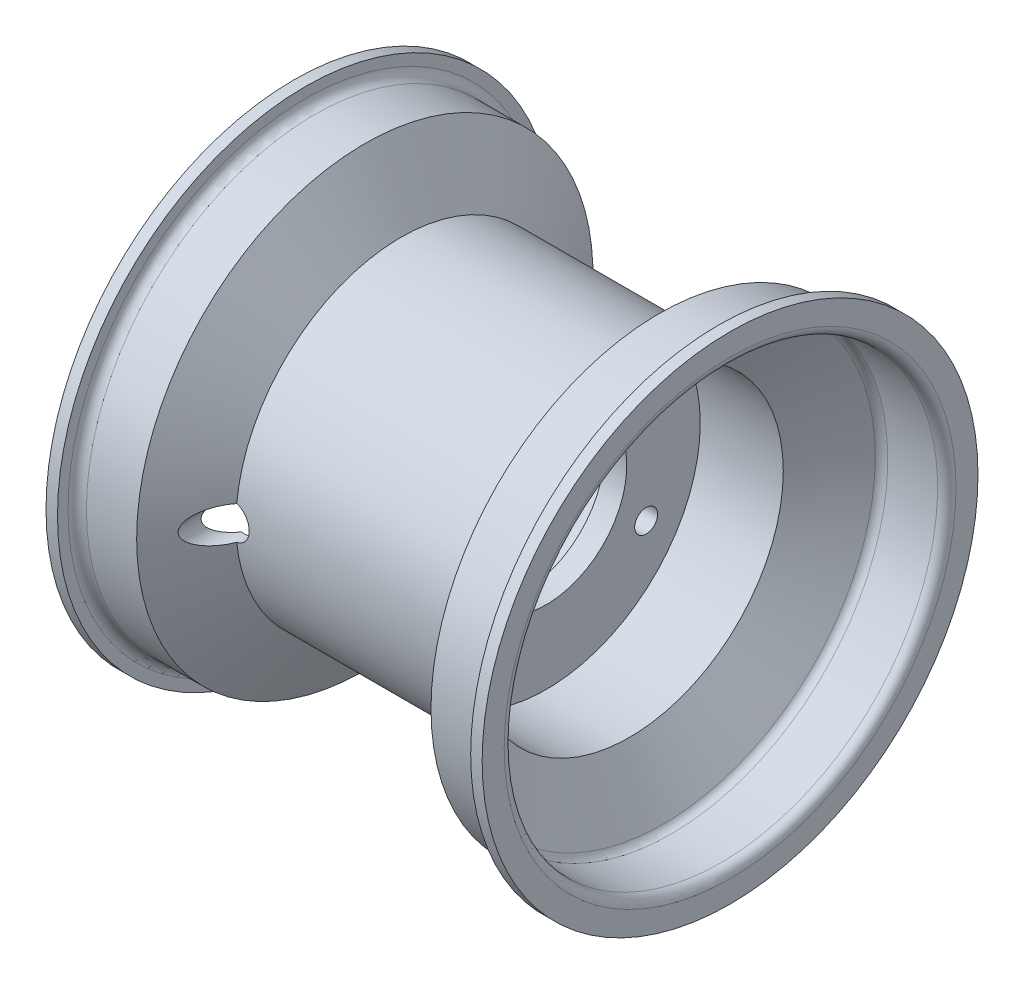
ISO-10303-21;
HEADER;
FILE_DESCRIPTION(('STEP AP214'),'2;1');
FILE_NAME('part.step','',(''),(''),'','','');
FILE_SCHEMA(('AUTOMOTIVE_DESIGN { 1 0 10303 214 1 1 1 1 }'));
ENDSEC;
DATA;
#1=APPLICATION_CONTEXT('core data for automotive mechanical design processes');
#2=APPLICATION_PROTOCOL_DEFINITION('international standard','automotive_design',2000,#1);
#3=PRODUCT_CONTEXT('',#1,'mechanical');
#4=PRODUCT('Part','Part','',(#3));
#5=PRODUCT_RELATED_PRODUCT_CATEGORY('part','',(#4));
#6=PRODUCT_DEFINITION_FORMATION('','',#4);
#7=PRODUCT_DEFINITION_CONTEXT('part definition',#1,'design');
#8=PRODUCT_DEFINITION('design','',#6,#7);
#9=PRODUCT_DEFINITION_SHAPE('','',#8);
#10=(LENGTH_UNIT() NAMED_UNIT(*) SI_UNIT(.MILLI.,.METRE.));
#11=(NAMED_UNIT(*) PLANE_ANGLE_UNIT() SI_UNIT($,.RADIAN.));
#12=(NAMED_UNIT(*) SI_UNIT($,.STERADIAN.) SOLID_ANGLE_UNIT());
#13=UNCERTAINTY_MEASURE_WITH_UNIT(LENGTH_MEASURE(1.E-05),#10,'distance_accuracy_value','');
#14=(GEOMETRIC_REPRESENTATION_CONTEXT(3) GLOBAL_UNCERTAINTY_ASSIGNED_CONTEXT((#13)) GLOBAL_UNIT_ASSIGNED_CONTEXT((#10,
#11,#12)) REPRESENTATION_CONTEXT('',''));
#15=CARTESIAN_POINT('',(0.,0.,0.));
#16=DIRECTION('',(0.,0.,1.));
#17=DIRECTION('',(1.,0.,0.));
#18=AXIS2_PLACEMENT_3D('',#15,#16,#17);
#19=CARTESIAN_POINT('',(-41.8117651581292,0.,0.));
#20=DIRECTION('',(-1.,0.,0.));
#21=DIRECTION('',(0.,0.,1.));
#22=AXIS2_PLACEMENT_3D('',#19,#20,#21);
#23=CONICAL_SURFACE('',#22,58.674,1.0471975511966);
#24=CARTESIAN_POINT('',(-41.8117651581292,0.,0.));
#25=DIRECTION('',(-1.,0.,0.));
#26=DIRECTION('',(0.,0.,1.));
#27=AXIS2_PLACEMENT_3D('',#24,#25,#26);
#28=CIRCLE('',#27,58.674);
#29=CARTESIAN_POINT('',(-41.8117651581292,0.,58.674));
#30=VERTEX_POINT('',#29);
#31=EDGE_CURVE('E128',#30,#30,#28,.T.);
#32=ORIENTED_EDGE('',*,*,#31,.T.);
#33=EDGE_LOOP('',(#32));
#34=FACE_BOUND('',#33,.T.);
#35=CARTESIAN_POINT('',(-32.0982009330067,-4.74975392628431,41.5792011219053));
#36=CARTESIAN_POINT('',(-32.1962882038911,-4.74255393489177,41.7510195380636));
#37=CARTESIAN_POINT('',(-32.2941819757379,-4.73233163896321,41.9228224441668));
#38=CARTESIAN_POINT('',(-32.4895074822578,-4.70577020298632,42.2662336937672));
#39=CARTESIAN_POINT('',(-32.5869391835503,-4.68943062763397,42.4378420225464));
#40=CARTESIAN_POINT('',(-32.781455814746,-4.65052253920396,42.7810365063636));
#41=CARTESIAN_POINT('',(-32.8785395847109,-4.62794100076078,42.9526218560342));
#42=CARTESIAN_POINT('',(-33.0720473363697,-4.57641931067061,43.2951884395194));
#43=CARTESIAN_POINT('',(-33.1684713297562,-4.54747927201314,43.4661696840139));
#44=CARTESIAN_POINT('',(-33.461641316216,-4.44915731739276,43.9868418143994));
#45=CARTESIAN_POINT('',(-33.6572202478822,-4.36925720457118,44.3353219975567));
#46=CARTESIAN_POINT('',(-33.9471570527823,-4.226754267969,44.8534301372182));
#47=CARTESIAN_POINT('',(-34.0431982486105,-4.17549936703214,45.0253057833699));
#48=CARTESIAN_POINT('',(-34.2339633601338,-4.06491032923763,45.3671726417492));
#49=CARTESIAN_POINT('',(-34.3286874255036,-4.00557711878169,45.5371640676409));
#50=CARTESIAN_POINT('',(-34.5331902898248,-3.86692562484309,45.9046465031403));
#51=CARTESIAN_POINT('',(-34.6426657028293,-3.78592885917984,46.101678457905));
#52=CARTESIAN_POINT('',(-34.8588668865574,-3.61050484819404,46.4913561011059));
#53=CARTESIAN_POINT('',(-34.9655918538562,-3.51607372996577,46.6840005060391));
#54=CARTESIAN_POINT('',(-35.1746101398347,-3.31278733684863,47.0617965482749));
#55=CARTESIAN_POINT('',(-35.2769305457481,-3.20404473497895,47.2469933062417));
#56=CARTESIAN_POINT('',(-35.4766305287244,-2.96940460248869,47.6088868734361));
#57=CARTESIAN_POINT('',(-35.5740144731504,-2.84352261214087,47.7855911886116));
#58=CARTESIAN_POINT('',(-35.7507730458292,-2.58774866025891,48.106674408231));
#59=CARTESIAN_POINT('',(-35.8309145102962,-2.46009806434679,48.2524029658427));
#60=CARTESIAN_POINT('',(-35.9839043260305,-2.18634281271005,48.5308381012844));
#61=CARTESIAN_POINT('',(-36.0567381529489,-2.04020266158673,48.6635187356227));
#62=CARTESIAN_POINT('',(-36.1582257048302,-1.80454715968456,48.8485301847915));
#63=CARTESIAN_POINT('',(-36.1909766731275,-1.72257595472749,48.9082596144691));
#64=CARTESIAN_POINT('',(-36.2530376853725,-1.55312735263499,49.0214806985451));
#65=CARTESIAN_POINT('',(-36.2823471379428,-1.46564901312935,49.0749712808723));
#66=CARTESIAN_POINT('',(-36.3366847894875,-1.28551108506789,49.1741671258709));
#67=CARTESIAN_POINT('',(-36.3617279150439,-1.19287113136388,49.2198995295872));
#68=CARTESIAN_POINT('',(-36.4068137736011,-1.0025240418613,49.3022514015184));
#69=CARTESIAN_POINT('',(-36.4268605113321,-0.904821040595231,49.3388781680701));
#70=CARTESIAN_POINT('',(-36.4654907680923,-0.679480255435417,49.4094694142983));
#71=CARTESIAN_POINT('',(-36.4823995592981,-0.550558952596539,49.4403768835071));
#72=CARTESIAN_POINT('',(-36.505557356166,-0.288666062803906,49.4827098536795));
#73=CARTESIAN_POINT('',(-36.5118156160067,-0.155698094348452,49.4941522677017));
#74=CARTESIAN_POINT('',(-36.5130780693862,0.110694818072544,49.4964603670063));
#75=CARTESIAN_POINT('',(-36.5080644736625,0.24412015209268,49.4872935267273));
#76=CARTESIAN_POINT('',(-36.4872519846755,0.507272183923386,49.4492468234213));
#77=CARTESIAN_POINT('',(-36.4714442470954,0.636995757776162,49.4203507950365));
#78=CARTESIAN_POINT('',(-36.4253084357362,0.921103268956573,49.3360399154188));
#79=CARTESIAN_POINT('',(-36.3923502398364,1.07361662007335,49.2758232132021));
#80=CARTESIAN_POINT('',(-36.31503828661,1.36556807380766,49.1346406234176));
#81=CARTESIAN_POINT('',(-36.2706633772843,1.50498124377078,49.0536362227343));
#82=CARTESIAN_POINT('',(-36.1843750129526,1.74061764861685,48.8962158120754));
#83=CARTESIAN_POINT('',(-36.1441272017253,1.83953076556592,48.8228191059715));
#84=CARTESIAN_POINT('',(-36.0595864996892,2.0297059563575,48.6687275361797));
#85=CARTESIAN_POINT('',(-36.0152912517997,2.12096351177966,48.5880284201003));
#86=CARTESIAN_POINT('',(-35.9234402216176,2.2964380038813,48.4207828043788));
#87=CARTESIAN_POINT('',(-35.8758794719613,2.38064376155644,48.3342273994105));
#88=CARTESIAN_POINT('',(-35.7781724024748,2.54247141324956,48.1565167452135));
#89=CARTESIAN_POINT('',(-35.7280251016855,2.62009077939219,48.0653597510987));
#90=CARTESIAN_POINT('',(-35.581565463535,2.83353613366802,47.7992959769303));
#91=CARTESIAN_POINT('',(-35.4826736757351,2.96194955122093,47.6198451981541));
#92=CARTESIAN_POINT('',(-35.2797928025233,3.20102096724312,47.2521735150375));
#93=CARTESIAN_POINT('',(-35.1757993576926,3.3116634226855,47.0639451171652));
#94=CARTESIAN_POINT('',(-34.9635805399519,3.51799688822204,46.6803660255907));
#95=CARTESIAN_POINT('',(-34.8553370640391,3.61361266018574,46.4849851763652));
#96=CARTESIAN_POINT('',(-34.6360343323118,3.791054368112,46.0897354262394));
#97=CARTESIAN_POINT('',(-34.5249758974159,3.87288427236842,45.8898678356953));
#98=CARTESIAN_POINT('',(-34.3193665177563,4.01153986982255,45.5204311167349));
#99=CARTESIAN_POINT('',(-34.2251563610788,4.07025908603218,45.3513766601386));
#100=CARTESIAN_POINT('',(-34.0354415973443,4.1797307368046,45.0114195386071));
#101=CARTESIAN_POINT('',(-33.9399368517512,4.23048231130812,44.840516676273));
#102=CARTESIAN_POINT('',(-33.6516413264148,4.37161989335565,44.3253762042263));
#103=CARTESIAN_POINT('',(-33.4571936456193,4.45080667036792,43.9789302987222));
#104=CARTESIAN_POINT('',(-33.1654441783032,4.54841565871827,43.4607996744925));
#105=CARTESIAN_POINT('',(-33.0692919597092,4.57720790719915,43.2903058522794));
#106=CARTESIAN_POINT('',(-32.8763325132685,4.62847218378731,42.9487195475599));
#107=CARTESIAN_POINT('',(-32.7795252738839,4.65094410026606,42.7776270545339));
#108=CARTESIAN_POINT('',(-32.5855592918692,4.68967068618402,42.4354107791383));
#109=CARTESIAN_POINT('',(-32.4884016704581,4.70593795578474,42.2642877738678));
#110=CARTESIAN_POINT('',(-32.2936271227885,4.73238960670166,41.9218486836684));
#111=CARTESIAN_POINT('',(-32.1960102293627,4.74257441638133,41.7505326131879));
#112=CARTESIAN_POINT('',(-32.0982009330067,4.74975392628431,41.5792011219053));
#113=B_SPLINE_CURVE_WITH_KNOTS('',3,(#35,#36,#37,#38,#39,#40,#41,#42,#43,#44,#45,#46,#47,#48,
#49,#50,#51,#52,#53,#54,#55,#56,#57,#58,#59,#60,#61,#62,#63,#64,#65,#66,#67,#68,#69,#70,#71,#72,
#73,#74,#75,#76,#77,#78,#79,#80,#81,#82,#83,#84,#85,#86,#87,#88,#89,#90,#91,#92,#93,#94,#95,#96,
#97,#98,#99,#100,#101,#102,#103,#104,#105,#106,#107,#108,#109,#110,#111,#112),.UNSPECIFIED.,.F.,
.F.,(4,2,2,2,2,2,2,2,2,2,2,2,2,2,2,2,2,2,2,2,2,2,2,2,2,2,2,2,2,2,2,2,2,2,2,2,2,2,4),(0.,
0.593904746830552,1.18785176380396,1.78304767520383,2.37823301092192,3.5995126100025,
4.20973239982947,4.81988226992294,5.53804397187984,6.25641312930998,6.96943171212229,
7.68180805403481,8.30979900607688,8.93901437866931,9.25845179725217,9.57794402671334,
9.89629440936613,10.2143887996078,10.6135446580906,11.0123535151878,11.4117922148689,
11.8115585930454,12.3105459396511,12.810464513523,13.1986756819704,13.5871143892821,
13.9761576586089,14.365349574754,15.0895717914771,15.8144240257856,16.5427972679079,
17.2709604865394,17.8775123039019,18.4841295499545,19.6981680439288,20.2916327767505,
20.8851079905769,21.4773714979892,22.0695932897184),.UNSPECIFIED.);
#114=CARTESIAN_POINT('',(-32.4996826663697,-4.70312472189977,42.2842481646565));
#115=VERTEX_POINT('',#114);
#116=CARTESIAN_POINT('',(-32.4996826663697,4.70312472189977,42.2842481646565));
#117=VERTEX_POINT('',#116);
#118=EDGE_CURVE('E52',#115,#117,#113,.T.);
#119=ORIENTED_EDGE('',*,*,#118,.F.);
#120=CARTESIAN_POINT('',(-32.4996826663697,0.,0.));
#121=DIRECTION('',(-1.,0.,0.));
#122=DIRECTION('',(0.,0.,1.));
#123=AXIS2_PLACEMENT_3D('',#120,#121,#122);
#124=CIRCLE('',#123,42.545);
#125=EDGE_CURVE('E125',#117,#115,#124,.T.);
#126=ORIENTED_EDGE('',*,*,#125,.F.);
#127=EDGE_LOOP('',(#119,#126));
#128=FACE_BOUND('',#127,.T.);
#129=ADVANCED_FACE('F33',(#34,#128),#23,.F.);
#130=CARTESIAN_POINT('',(0.,0.,0.));
#131=DIRECTION('',(-1.,0.,0.));
#132=DIRECTION('',(0.,0.,1.));
#133=AXIS2_PLACEMENT_3D('',#130,#131,#132);
#134=CYLINDRICAL_SURFACE('',#133,42.545);
#135=CARTESIAN_POINT('',(3.30199999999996,0.,0.));
#136=DIRECTION('',(-1.,0.,0.));
#137=DIRECTION('',(0.,0.,1.));
#138=AXIS2_PLACEMENT_3D('',#135,#136,#137);
#139=CIRCLE('',#138,42.545);
#140=CARTESIAN_POINT('',(3.30199999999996,0.,42.545));
#141=VERTEX_POINT('',#140);
#142=EDGE_CURVE('E122',#141,#141,#139,.T.);
#143=ORIENTED_EDGE('',*,*,#142,.F.);
#144=EDGE_LOOP('',(#143));
#145=FACE_BOUND('',#144,.T.);
#146=CARTESIAN_POINT('',(-32.4996826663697,4.70312472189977,42.2842481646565));
#147=CARTESIAN_POINT('',(-32.3680935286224,4.72411516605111,42.2819086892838));
#148=CARTESIAN_POINT('',(-32.2356105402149,4.73955556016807,42.2801800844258));
#149=CARTESIAN_POINT('',(-31.9698134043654,4.75928658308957,42.2779661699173));
#150=CARTESIAN_POINT('',(-31.8364993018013,4.76357780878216,42.2774807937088));
#151=CARTESIAN_POINT('',(-31.5701044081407,4.76096428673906,42.2777745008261));
#152=CARTESIAN_POINT('',(-31.4370235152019,4.7540698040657,42.2785524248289));
#153=CARTESIAN_POINT('',(-31.1719217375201,4.72915994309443,42.2813461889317));
#154=CARTESIAN_POINT('',(-31.0399008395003,4.71114470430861,42.2833620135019));
#155=CARTESIAN_POINT('',(-30.777821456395,4.66411885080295,42.2885750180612));
#156=CARTESIAN_POINT('',(-30.6477634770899,4.63510545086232,42.2917724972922));
#157=CARTESIAN_POINT('',(-30.3905167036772,4.56628360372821,42.2992585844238));
#158=CARTESIAN_POINT('',(-30.2633289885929,4.52647116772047,42.3035475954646));
#159=CARTESIAN_POINT('',(-30.0128321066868,4.43636809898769,42.3130915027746));
#160=CARTESIAN_POINT('',(-29.8895209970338,4.38608281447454,42.3183459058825));
#161=CARTESIAN_POINT('',(-29.6475271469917,4.27536265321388,42.3296751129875));
#162=CARTESIAN_POINT('',(-29.5288461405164,4.21492401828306,42.3357502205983));
#163=CARTESIAN_POINT('',(-29.2967179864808,4.08418884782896,42.3485625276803));
#164=CARTESIAN_POINT('',(-29.1832836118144,4.01386978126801,42.3553012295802));
#165=CARTESIAN_POINT('',(-28.9626925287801,3.86395057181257,42.3692409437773));
#166=CARTESIAN_POINT('',(-28.8555381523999,3.78434701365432,42.3764421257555));
#167=CARTESIAN_POINT('',(-28.6483171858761,3.61645525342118,42.3911001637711));
#168=CARTESIAN_POINT('',(-28.5482492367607,3.52816872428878,42.3985569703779));
#169=CARTESIAN_POINT('',(-28.3558382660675,3.34348051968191,42.4135208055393));
#170=CARTESIAN_POINT('',(-28.2634981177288,3.24707585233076,42.4210278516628));
#171=CARTESIAN_POINT('',(-28.08681485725,3.0463811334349,42.4359135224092));
#172=CARTESIAN_POINT('',(-28.0025112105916,2.9420562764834,42.4432913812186));
#173=CARTESIAN_POINT('',(-27.8429599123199,2.72661311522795,42.4576761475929));
#174=CARTESIAN_POINT('',(-27.7677156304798,2.61549230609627,42.4646829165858));
#175=CARTESIAN_POINT('',(-27.6268867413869,2.38732233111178,42.4781210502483));
#176=CARTESIAN_POINT('',(-27.5612979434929,2.27027576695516,42.4845526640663));
#177=CARTESIAN_POINT('',(-27.4401905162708,2.03099458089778,42.4966639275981));
#178=CARTESIAN_POINT('',(-27.3846755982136,1.90875806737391,42.5023432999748));
#179=CARTESIAN_POINT('',(-27.2842270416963,1.66018358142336,42.5127774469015));
#180=CARTESIAN_POINT('',(-27.2392771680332,1.5338522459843,42.5175336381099));
#181=CARTESIAN_POINT('',(-27.1601633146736,1.27780945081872,42.5260002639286));
#182=CARTESIAN_POINT('',(-27.1260033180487,1.14809676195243,42.5297103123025));
#183=CARTESIAN_POINT('',(-27.0401752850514,0.755358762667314,42.5390952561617));
#184=CARTESIAN_POINT('',(-27.0050475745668,0.48845667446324,42.5430369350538));
#185=CARTESIAN_POINT('',(-26.9802437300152,-0.0458011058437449,42.5458116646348));
#186=CARTESIAN_POINT('',(-26.9903156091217,-0.313145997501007,42.5446730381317));
#187=CARTESIAN_POINT('',(-27.0550492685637,-0.842492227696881,42.5374790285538));
#188=CARTESIAN_POINT('',(-27.1097105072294,-1.10449363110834,42.5314237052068));
#189=CARTESIAN_POINT('',(-27.2237519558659,-1.48737810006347,42.5191863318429));
#190=CARTESIAN_POINT('',(-27.2671012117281,-1.6133074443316,42.5145821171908));
#191=CARTESIAN_POINT('',(-27.3641653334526,-1.86105464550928,42.504456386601));
#192=CARTESIAN_POINT('',(-27.417876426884,-1.98287397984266,42.4989352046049));
#193=CARTESIAN_POINT('',(-27.5353089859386,-2.22159809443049,42.4871255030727));
#194=CARTESIAN_POINT('',(-27.5990344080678,-2.33850090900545,42.4808366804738));
#195=CARTESIAN_POINT('',(-27.7360044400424,-2.5665000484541,42.4676716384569));
#196=CARTESIAN_POINT('',(-27.8092456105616,-2.67759845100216,42.4607956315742));
#197=CARTESIAN_POINT('',(-27.9651684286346,-2.89384185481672,42.4466077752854));
#198=CARTESIAN_POINT('',(-28.0478986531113,-2.99895168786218,42.4392937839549));
#199=CARTESIAN_POINT('',(-28.2218645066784,-3.20179828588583,42.4244723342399));
#200=CARTESIAN_POINT('',(-28.3130970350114,-3.29953771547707,42.4169649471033));
#201=CARTESIAN_POINT('',(-28.503486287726,-3.48703480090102,42.4019629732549));
#202=CARTESIAN_POINT('',(-28.6026456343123,-3.57678979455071,42.3944683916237));
#203=CARTESIAN_POINT('',(-28.8081317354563,-3.74762095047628,42.3797087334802));
#204=CARTESIAN_POINT('',(-28.9144558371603,-3.8287002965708,42.3724435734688));
#205=CARTESIAN_POINT('',(-29.1339785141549,-3.98193714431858,42.3583185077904));
#206=CARTESIAN_POINT('',(-29.247201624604,-4.05405965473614,42.3514602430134));
#207=CARTESIAN_POINT('',(-29.479315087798,-4.1884813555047,42.3383775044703));
#208=CARTESIAN_POINT('',(-29.5982033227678,-4.25078417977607,42.3321527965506));
#209=CARTESIAN_POINT('',(-29.8409318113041,-4.36518944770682,42.3205087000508));
#210=CARTESIAN_POINT('',(-29.9647755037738,-4.41728465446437,42.3150898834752));
#211=CARTESIAN_POINT('',(-30.2164075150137,-4.51082146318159,42.3052210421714));
#212=CARTESIAN_POINT('',(-30.3441943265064,-4.55226708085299,42.3007706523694));
#213=CARTESIAN_POINT('',(-30.6025329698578,-4.62413872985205,42.2929742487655));
#214=CARTESIAN_POINT('',(-30.7330774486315,-4.65459090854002,42.2896256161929));
#215=CARTESIAN_POINT('',(-30.9962434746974,-4.70437915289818,42.2841160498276));
#216=CARTESIAN_POINT('',(-31.1288642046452,-4.72371948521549,42.2819546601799));
#217=CARTESIAN_POINT('',(-31.3951087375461,-4.75114179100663,42.2788820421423));
#218=CARTESIAN_POINT('',(-31.5287310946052,-4.75923767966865,42.2779692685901));
#219=CARTESIAN_POINT('',(-31.7961312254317,-4.76415204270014,42.2774158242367));
#220=CARTESIAN_POINT('',(-31.9299088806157,-4.76097644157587,42.2777744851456));
#221=CARTESIAN_POINT('',(-32.136407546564,-4.74736457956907,42.2793043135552));
#222=CARTESIAN_POINT('',(-32.2094115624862,-4.74085609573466,42.2800352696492));
#223=CARTESIAN_POINT('',(-32.3549241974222,-4.72449199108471,42.2818668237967));
#224=CARTESIAN_POINT('',(-32.4274334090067,-4.71464157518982,42.282966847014));
#225=CARTESIAN_POINT('',(-32.4996826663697,-4.70312472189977,42.2842481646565));
#226=B_SPLINE_CURVE_WITH_KNOTS('',3,(#146,#147,#148,#149,#150,#151,#152,#153,#154,#155,#156,
#157,#158,#159,#160,#161,#162,#163,#164,#165,#166,#167,#168,#169,#170,#171,#172,#173,#174,#175,
#176,#177,#178,#179,#180,#181,#182,#183,#184,#185,#186,#187,#188,#189,#190,#191,#192,#193,#194,
#195,#196,#197,#198,#199,#200,#201,#202,#203,#204,#205,#206,#207,#208,#209,#210,#211,#212,#213,
#214,#215,#216,#217,#218,#219,#220,#221,#222,#223,#224,#225),.UNSPECIFIED.,.F.,.F.,(4,2,2,2,2,2,
2,2,2,2,2,2,2,2,2,2,2,2,2,2,2,2,2,2,2,2,2,2,2,2,2,2,2,2,2,2,2,2,2,4),(0.,0.399698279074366,
0.799375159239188,1.19868546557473,1.59799076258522,1.99739724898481,2.39695146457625,
2.79630213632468,3.19580095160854,3.59622602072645,3.99679885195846,4.39729465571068,
4.79793871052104,5.20045854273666,5.60312763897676,6.00562145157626,6.40826324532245,
6.81028219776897,7.2124493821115,8.01589890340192,8.81487479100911,9.61384097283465,
10.0132412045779,10.4124963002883,10.8119095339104,11.2111788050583,11.6125918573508,
12.013859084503,12.4152596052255,12.8165123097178,13.2192863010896,13.6219108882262,
14.024819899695,14.4275767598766,14.8293692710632,15.2310074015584,15.6321480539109,
16.0330778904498,16.2528994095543,16.4723801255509),.UNSPECIFIED.);
#227=EDGE_CURVE('E70',#117,#115,#226,.T.);
#228=ORIENTED_EDGE('',*,*,#227,.F.);
#229=ORIENTED_EDGE('',*,*,#125,.T.);
#230=EDGE_LOOP('',(#228,#229));
#231=FACE_BOUND('',#230,.T.);
#232=ADVANCED_FACE('F181',(#145,#231),#134,.F.);
#233=CARTESIAN_POINT('',(0.,0.,0.));
#234=DIRECTION('',(-1.,0.,0.));
#235=DIRECTION('',(0.,0.,1.));
#236=AXIS2_PLACEMENT_3D('',#233,#234,#235);
#237=CYLINDRICAL_SURFACE('',#236,45.72);
#238=CARTESIAN_POINT('',(30.6665955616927,0.,0.));
#239=DIRECTION('',(-1.,0.,0.));
#240=DIRECTION('',(0.,0.,1.));
#241=AXIS2_PLACEMENT_3D('',#238,#239,#240);
#242=CIRCLE('',#241,45.72);
#243=CARTESIAN_POINT('',(30.6665955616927,0.,45.72));
#244=VERTEX_POINT('',#243);
#245=EDGE_CURVE('E73',#244,#244,#242,.T.);
#246=ORIENTED_EDGE('',*,*,#245,.T.);
#247=EDGE_LOOP('',(#246));
#248=FACE_BOUND('',#247,.T.);
#249=CARTESIAN_POINT('',(-30.6665955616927,-4.63763313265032,45.4841814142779));
#250=CARTESIAN_POINT('',(-30.5361722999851,-4.60717966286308,45.4872830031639));
#251=CARTESIAN_POINT('',(-30.4070563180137,-4.57120066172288,45.4909240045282));
#252=CARTESIAN_POINT('',(-30.1523464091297,-4.48851857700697,45.4991583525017));
#253=CARTESIAN_POINT('',(-30.0267522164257,-4.44181630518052,45.5037516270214));
#254=CARTESIAN_POINT('',(-29.7800761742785,-4.33805319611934,45.5137603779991));
#255=CARTESIAN_POINT('',(-29.6589906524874,-4.28100102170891,45.5191751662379));
#256=CARTESIAN_POINT('',(-29.4220742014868,-4.15692746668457,45.530673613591));
#257=CARTESIAN_POINT('',(-29.3062432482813,-4.08990613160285,45.5367572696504));
#258=CARTESIAN_POINT('',(-29.0806313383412,-3.94636001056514,45.5494218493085));
#259=CARTESIAN_POINT('',(-28.9708513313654,-3.869833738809,45.5560028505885));
#260=CARTESIAN_POINT('',(-28.7580901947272,-3.70779841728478,45.5694770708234));
#261=CARTESIAN_POINT('',(-28.6551115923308,-3.62228605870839,45.5763704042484));
#262=CARTESIAN_POINT('',(-28.4567688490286,-3.44294950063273,45.5902684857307));
#263=CARTESIAN_POINT('',(-28.3614008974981,-3.34912951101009,45.5972731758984));
#264=CARTESIAN_POINT('',(-28.1788561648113,-3.15376240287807,45.6112022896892));
#265=CARTESIAN_POINT('',(-28.0916824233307,-3.05221244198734,45.6181266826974));
#266=CARTESIAN_POINT('',(-27.9259955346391,-2.84189325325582,45.6317123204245));
#267=CARTESIAN_POINT('',(-27.8475020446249,-2.73310849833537,45.6383729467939));
#268=CARTESIAN_POINT('',(-27.6999297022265,-2.50924623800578,45.6512284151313));
#269=CARTESIAN_POINT('',(-27.6308543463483,-2.39416641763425,45.6574230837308));
#270=CARTESIAN_POINT('',(-27.502663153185,-2.15859050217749,45.6691667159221));
#271=CARTESIAN_POINT('',(-27.4435449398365,-2.03809570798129,45.6747158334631));
#272=CARTESIAN_POINT('',(-27.3356553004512,-1.79247560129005,45.6850144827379));
#273=CARTESIAN_POINT('',(-27.2868876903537,-1.66734860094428,45.6897637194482));
#274=CARTESIAN_POINT('',(-27.200188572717,-1.41369519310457,45.6983141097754));
#275=CARTESIAN_POINT('',(-27.1622309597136,-1.28517780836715,45.7021175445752));
#276=CARTESIAN_POINT('',(-27.0972589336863,-1.0253628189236,45.708685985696));
#277=CARTESIAN_POINT('',(-27.0702486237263,-0.894064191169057,45.7114506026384));
#278=CARTESIAN_POINT('',(-27.0060158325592,-0.497547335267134,45.7180528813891));
#279=CARTESIAN_POINT('',(-26.9854872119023,-0.229402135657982,45.7202095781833));
#280=CARTESIAN_POINT('',(-26.9898146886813,0.305248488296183,45.7197589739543));
#281=CARTESIAN_POINT('',(-27.0144576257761,0.571755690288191,45.7171740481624));
#282=CARTESIAN_POINT('',(-27.0844520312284,0.965355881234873,45.709997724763));
#283=CARTESIAN_POINT('',(-27.1133144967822,1.09560196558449,45.7070531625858));
#284=CARTESIAN_POINT('',(-27.1818435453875,1.35317518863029,45.7001516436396));
#285=CARTESIAN_POINT('',(-27.2215061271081,1.4805033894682,45.6961950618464));
#286=CARTESIAN_POINT('',(-27.3113670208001,1.73139029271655,45.6873775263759));
#287=CARTESIAN_POINT('',(-27.3615687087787,1.85494777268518,45.682516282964));
#288=CARTESIAN_POINT('',(-27.4721192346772,2.09735033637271,45.6720289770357));
#289=CARTESIAN_POINT('',(-27.5324643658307,2.2161971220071,45.6664031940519));
#290=CARTESIAN_POINT('',(-27.6629024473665,2.44842425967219,45.6545413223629));
#291=CARTESIAN_POINT('',(-27.732997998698,2.56180314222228,45.6483050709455));
#292=CARTESIAN_POINT('',(-27.8824023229,2.78223212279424,45.6354004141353));
#293=CARTESIAN_POINT('',(-27.9617077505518,2.88928449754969,45.6287321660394));
#294=CARTESIAN_POINT('',(-28.1294212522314,3.09688756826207,45.6151133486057));
#295=CARTESIAN_POINT('',(-28.2178734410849,3.19740254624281,45.6081615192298));
#296=CARTESIAN_POINT('',(-28.4028877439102,3.39059398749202,45.5942063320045));
#297=CARTESIAN_POINT('',(-28.4994468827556,3.48327330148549,45.5872029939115));
#298=CARTESIAN_POINT('',(-28.7000730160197,3.6602255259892,45.573336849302));
#299=CARTESIAN_POINT('',(-28.8041435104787,3.74449447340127,45.5664741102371));
#300=CARTESIAN_POINT('',(-29.0189830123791,3.90395193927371,45.5530894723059));
#301=CARTESIAN_POINT('',(-29.1297494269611,3.97914393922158,45.5465674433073));
#302=CARTESIAN_POINT('',(-29.3530116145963,4.11733448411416,45.5342793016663));
#303=CARTESIAN_POINT('',(-29.4652904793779,4.18068210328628,45.5284941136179));
#304=CARTESIAN_POINT('',(-29.6946359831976,4.2980788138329,45.5175613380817));
#305=CARTESIAN_POINT('',(-29.8117024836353,4.35212817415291,45.5124137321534));
#306=CARTESIAN_POINT('',(-30.0499175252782,4.45058822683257,45.5028914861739));
#307=CARTESIAN_POINT('',(-30.1710680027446,4.49499427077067,45.4985172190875));
#308=CARTESIAN_POINT('',(-30.4166067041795,4.57385275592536,45.4906558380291));
#309=CARTESIAN_POINT('',(-30.5409952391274,4.60830423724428,45.4871688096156));
#310=CARTESIAN_POINT('',(-30.6665955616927,4.63763313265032,45.4841814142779));
#311=B_SPLINE_CURVE_WITH_KNOTS('',3,(#249,#250,#251,#252,#253,#254,#255,#256,#257,#258,#259,
#260,#261,#262,#263,#264,#265,#266,#267,#268,#269,#270,#271,#272,#273,#274,#275,#276,#277,#278,
#279,#280,#281,#282,#283,#284,#285,#286,#287,#288,#289,#290,#291,#292,#293,#294,#295,#296,#297,
#298,#299,#300,#301,#302,#303,#304,#305,#306,#307,#308,#309,#310),.UNSPECIFIED.,.F.,.F.,(4,2,2,
2,2,2,2,2,2,2,2,2,2,2,2,2,2,2,2,2,2,2,2,2,2,2,2,2,2,2,4),(0.,0.401776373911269,
0.803522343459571,1.20493359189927,1.60634300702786,2.00781524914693,2.40943584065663,
2.81085406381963,3.21242061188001,3.61487868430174,4.0174857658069,4.41999663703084,
4.82265564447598,5.22433384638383,5.62616245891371,6.42886179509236,7.2277830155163,
7.62770173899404,8.02747249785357,8.42737151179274,8.82712470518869,9.22698473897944,
9.62669998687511,10.0284419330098,10.4300370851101,10.8318205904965,11.2334494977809,
11.6201663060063,12.0068719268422,12.3937635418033,12.7806924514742),.UNSPECIFIED.);
#312=CARTESIAN_POINT('',(-30.6665955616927,-4.63763313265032,45.4841814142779));
#313=VERTEX_POINT('',#312);
#314=CARTESIAN_POINT('',(-30.6665955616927,4.63763313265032,45.4841814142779));
#315=VERTEX_POINT('',#314);
#316=EDGE_CURVE('E58',#313,#315,#311,.T.);
#317=ORIENTED_EDGE('',*,*,#316,.F.);
#318=CARTESIAN_POINT('',(-30.6665955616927,0.,0.));
#319=DIRECTION('',(-1.,0.,0.));
#320=DIRECTION('',(0.,0.,1.));
#321=AXIS2_PLACEMENT_3D('',#318,#319,#320);
#322=CIRCLE('',#321,45.72);
#323=EDGE_CURVE('E69',#315,#313,#322,.T.);
#324=ORIENTED_EDGE('',*,*,#323,.F.);
#325=EDGE_LOOP('',(#317,#324));
#326=FACE_BOUND('',#325,.T.);
#327=ADVANCED_FACE('F68',(#248,#326),#237,.T.);
#328=CARTESIAN_POINT('',(-30.6665955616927,0.,0.));
#329=DIRECTION('',(-1.,0.,0.));
#330=DIRECTION('',(0.,0.,1.));
#331=AXIS2_PLACEMENT_3D('',#328,#329,#330);
#332=CONICAL_SURFACE('',#331,45.72,1.0471975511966);
#333=CARTESIAN_POINT('',(-40.7119128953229,0.,0.));
#334=DIRECTION('',(-1.,0.,0.));
#335=DIRECTION('',(0.,0.,1.));
#336=AXIS2_PLACEMENT_3D('',#333,#334,#335);
#337=CIRCLE('',#336,63.119);
#338=CARTESIAN_POINT('',(-40.7119128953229,0.,63.119));
#339=VERTEX_POINT('',#338);
#340=EDGE_CURVE('E74',#339,#339,#337,.T.);
#341=ORIENTED_EDGE('',*,*,#340,.F.);
#342=EDGE_LOOP('',(#341));
#343=FACE_BOUND('',#342,.T.);
#344=CARTESIAN_POINT('',(-30.081805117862,4.46077707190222,44.484013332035));
#345=CARTESIAN_POINT('',(-30.2086509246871,4.50817327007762,44.7000602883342));
#346=CARTESIAN_POINT('',(-30.3357900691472,4.5495939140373,44.9172060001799));
#347=CARTESIAN_POINT('',(-30.5903567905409,4.62106064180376,45.3531404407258));
#348=CARTESIAN_POINT('',(-30.7177843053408,4.65110897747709,45.5719288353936));
#349=CARTESIAN_POINT('',(-30.9727332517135,4.70043625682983,46.0107718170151));
#350=CARTESIAN_POINT('',(-31.100254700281,4.71971069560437,46.2308268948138));
#351=CARTESIAN_POINT('',(-31.3551336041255,4.74783446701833,46.6717106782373));
#352=CARTESIAN_POINT('',(-31.4824910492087,4.75668318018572,46.8925394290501));
#353=CARTESIAN_POINT('',(-31.7380235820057,4.76421563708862,47.3366271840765));
#354=CARTESIAN_POINT('',(-31.8661952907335,4.76280429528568,47.5598897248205));
#355=CARTESIAN_POINT('',(-32.1219861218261,4.74967718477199,48.0064284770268));
#356=CARTESIAN_POINT('',(-32.2496052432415,4.73796139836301,48.2297046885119));
#357=CARTESIAN_POINT('',(-32.5040662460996,4.70417463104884,48.6758233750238));
#358=CARTESIAN_POINT('',(-32.6309083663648,4.68210701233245,48.8986659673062));
#359=CARTESIAN_POINT('',(-32.8836469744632,4.62741455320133,49.3435657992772));
#360=CARTESIAN_POINT('',(-33.0095435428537,4.59479062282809,49.5656231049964));
#361=CARTESIAN_POINT('',(-33.283106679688,4.51165257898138,50.0490381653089));
#362=CARTESIAN_POINT('',(-33.4305435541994,4.45895772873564,50.3101558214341));
#363=CARTESIAN_POINT('',(-33.7233367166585,4.33733603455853,50.8297806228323));
#364=CARTESIAN_POINT('',(-33.8686930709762,4.26840970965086,51.0882878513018));
#365=CARTESIAN_POINT('',(-34.1563787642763,4.11307882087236,51.600908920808));
#366=CARTESIAN_POINT('',(-34.2987143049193,4.02671488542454,51.8550315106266));
#367=CARTESIAN_POINT('',(-34.5798000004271,3.83440519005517,52.3577769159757));
#368=CARTESIAN_POINT('',(-34.7185515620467,3.72846725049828,52.6064018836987));
#369=CARTESIAN_POINT('',(-34.9337556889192,3.54343145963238,52.9926578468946));
#370=CARTESIAN_POINT('',(-35.0118515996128,3.47180140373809,53.1329650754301));
#371=CARTESIAN_POINT('',(-35.1660008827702,3.32024624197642,53.4101632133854));
#372=CARTESIAN_POINT('',(-35.2420547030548,3.24032297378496,53.5470548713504));
#373=CARTESIAN_POINT('',(-35.3915933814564,3.07130835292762,53.8164466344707));
#374=CARTESIAN_POINT('',(-35.4650794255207,2.98222130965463,53.9489487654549));
#375=CARTESIAN_POINT('',(-35.6087787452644,2.79378920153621,54.2082606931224));
#376=CARTESIAN_POINT('',(-35.6789932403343,2.69444800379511,54.3350726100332));
#377=CARTESIAN_POINT('',(-35.8367780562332,2.45090389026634,54.6202539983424));
#378=CARTESIAN_POINT('',(-35.9228111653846,2.30245133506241,54.77591417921));
#379=CARTESIAN_POINT('',(-36.084060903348,1.98226018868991,55.0679077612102));
#380=CARTESIAN_POINT('',(-36.1592951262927,1.81056038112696,55.2042725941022));
#381=CARTESIAN_POINT('',(-36.2729580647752,1.49762362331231,55.4104235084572));
#382=CARTESIAN_POINT('',(-36.3156201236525,1.36301594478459,55.4878423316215));
#383=CARTESIAN_POINT('',(-36.3903151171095,1.08164796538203,55.6234378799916));
#384=CARTESIAN_POINT('',(-36.4223650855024,0.934907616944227,55.6816454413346));
#385=CARTESIAN_POINT('',(-36.4687437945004,0.65674240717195,55.7658931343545));
#386=CARTESIAN_POINT('',(-36.4851284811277,0.526806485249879,55.7956643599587));
#387=CARTESIAN_POINT('',(-36.507065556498,0.263052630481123,55.8355267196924));
#388=CARTESIAN_POINT('',(-36.5126258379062,0.129237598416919,55.8456321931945));
#389=CARTESIAN_POINT('',(-36.5123696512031,-0.138508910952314,55.8451666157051));
#390=CARTESIAN_POINT('',(-36.5065392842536,-0.272440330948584,55.8345703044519));
#391=CARTESIAN_POINT('',(-36.4840619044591,-0.536332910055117,55.7937263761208));
#392=CARTESIAN_POINT('',(-36.4674067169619,-0.666290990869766,55.7634639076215));
#393=CARTESIAN_POINT('',(-36.4191306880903,-0.952243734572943,55.6757706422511));
#394=CARTESIAN_POINT('',(-36.3847430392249,-1.10621199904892,55.6133188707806));
#395=CARTESIAN_POINT('',(-36.3044420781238,-1.40067898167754,55.4675553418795));
#396=CARTESIAN_POINT('',(-36.2585055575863,-1.54114978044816,55.3842015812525));
#397=CARTESIAN_POINT('',(-36.169194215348,-1.77890850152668,55.2222375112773));
#398=CARTESIAN_POINT('',(-36.127470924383,-1.87890652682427,55.1466030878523));
#399=CARTESIAN_POINT('',(-36.0399220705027,-2.07102052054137,54.9879765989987));
#400=CARTESIAN_POINT('',(-35.9940940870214,-2.16313177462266,54.9049801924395));
#401=CARTESIAN_POINT('',(-35.8991403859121,-2.340115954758,54.7331077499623));
#402=CARTESIAN_POINT('',(-35.8500097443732,-2.42497762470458,54.6442229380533));
#403=CARTESIAN_POINT('',(-35.7491381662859,-2.58794847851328,54.4618359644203));
#404=CARTESIAN_POINT('',(-35.6973962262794,-2.66605503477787,54.3683320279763));
#405=CARTESIAN_POINT('',(-35.5461118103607,-2.88102281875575,54.0951099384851));
#406=CARTESIAN_POINT('',(-35.4439520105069,-3.0102371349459,53.9108065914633));
#407=CARTESIAN_POINT('',(-35.2344894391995,-3.2504020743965,53.5333965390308));
#408=CARTESIAN_POINT('',(-35.1271823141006,-3.36133687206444,53.3402823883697));
#409=CARTESIAN_POINT('',(-34.9085882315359,-3.56753954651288,52.9474206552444));
#410=CARTESIAN_POINT('',(-34.797293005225,-3.6627722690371,52.7476593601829));
#411=CARTESIAN_POINT('',(-34.5718256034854,-3.83916559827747,52.3435526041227));
#412=CARTESIAN_POINT('',(-34.4576524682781,-3.92032143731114,52.139205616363));
#413=CARTESIAN_POINT('',(-34.2346997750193,-4.06498925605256,51.7407699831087));
#414=CARTESIAN_POINT('',(-34.1260615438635,-4.12931219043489,51.5468943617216));
#415=CARTESIAN_POINT('',(-33.9072030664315,-4.24774797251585,51.1569011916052));
#416=CARTESIAN_POINT('',(-33.7969825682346,-4.30185917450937,50.9607832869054));
#417=CARTESIAN_POINT('',(-33.5751850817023,-4.40055099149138,50.5667508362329));
#418=CARTESIAN_POINT('',(-33.4636072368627,-4.44512521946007,50.368835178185));
#419=CARTESIAN_POINT('',(-33.2393848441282,-4.52518507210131,49.9717642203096));
#420=CARTESIAN_POINT('',(-33.1267401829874,-4.56066972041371,49.772608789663));
#421=CARTESIAN_POINT('',(-32.7875576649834,-4.65402577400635,49.1739668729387));
#422=CARTESIAN_POINT('',(-32.5596807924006,-4.69883875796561,48.77314395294));
#423=CARTESIAN_POINT('',(-32.1017513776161,-4.75508637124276,47.9707117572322));
#424=CARTESIAN_POINT('',(-31.8717000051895,-4.76653802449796,47.5691029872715));
#425=CARTESIAN_POINT('',(-31.511052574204,-4.75827527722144,46.9421016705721));
#426=CARTESIAN_POINT('',(-31.3808587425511,-4.74997924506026,46.7162796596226));
#427=CARTESIAN_POINT('',(-31.1202983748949,-4.72250395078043,46.2654391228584));
#428=CARTESIAN_POINT('',(-30.9899318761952,-4.70332674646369,46.0404204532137));
#429=CARTESIAN_POINT('',(-30.729750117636,-4.65381452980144,45.5924857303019));
#430=CARTESIAN_POINT('',(-30.5999347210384,-4.62352404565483,45.3695648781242));
#431=CARTESIAN_POINT('',(-30.3405802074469,-4.55115094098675,44.9253874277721));
#432=CARTESIAN_POINT('',(-30.2110411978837,-4.50906436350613,44.7041314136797));
#433=CARTESIAN_POINT('',(-30.081805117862,-4.46077707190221,44.484013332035));
#434=B_SPLINE_CURVE_WITH_KNOTS('',3,(#344,#345,#346,#347,#348,#349,#350,#351,#352,#353,#354,
#355,#356,#357,#358,#359,#360,#361,#362,#363,#364,#365,#366,#367,#368,#369,#370,#371,#372,#373,
#374,#375,#376,#377,#378,#379,#380,#381,#382,#383,#384,#385,#386,#387,#388,#389,#390,#391,#392,
#393,#394,#395,#396,#397,#398,#399,#400,#401,#402,#403,#404,#405,#406,#407,#408,#409,#410,#411,
#412,#413,#414,#415,#416,#417,#418,#419,#420,#421,#422,#423,#424,#425,#426,#427,#428,#429,#430,
#431,#432,#433),.UNSPECIFIED.,.F.,.F.,(4,2,2,2,2,2,2,2,2,2,2,2,2,2,2,2,2,2,2,2,2,2,2,2,2,2,2,2,
2,2,2,2,2,2,2,2,2,2,2,2,2,2,2,2,4),(0.,0.764804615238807,1.52945770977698,2.29443029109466,
3.05944832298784,3.83156517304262,4.60368334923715,5.37555092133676,6.14735196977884,
7.06031172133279,7.97324228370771,8.88406983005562,9.79453425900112,10.3218256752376,
10.8490004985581,11.3759285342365,11.9026585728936,12.5960361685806,13.2882709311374,
13.7698588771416,14.2506700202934,14.6518433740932,15.0527241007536,15.454094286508,
15.8557679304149,16.3619805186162,16.869218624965,17.2651009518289,17.6612182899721,
18.057939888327,18.4548151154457,19.1951350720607,19.9360926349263,20.6786871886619,
21.4215327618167,22.1153532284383,22.8092854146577,23.5036808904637,24.1981509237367,
25.5865264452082,26.974193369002,27.7563865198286,28.5384317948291,29.3173772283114,
30.0965842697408),.UNSPECIFIED.);
#435=EDGE_CURVE('E11',#315,#313,#434,.T.);
#436=ORIENTED_EDGE('',*,*,#435,.F.);
#437=ORIENTED_EDGE('',*,*,#323,.T.);
#438=EDGE_LOOP('',(#436,#437));
#439=FACE_BOUND('',#438,.T.);
#440=ADVANCED_FACE('F72',(#343,#439),#332,.T.);
#441=CARTESIAN_POINT('',(-60.325,62.484,0.));
#442=DIRECTION('',(1.,0.,0.));
#443=DIRECTION('',(0.,0.,-1.));
#444=AXIS2_PLACEMENT_3D('',#441,#442,#443);
#445=PLANE('',#444);
#446=CARTESIAN_POINT('',(-60.325,0.,0.));
#447=DIRECTION('',(-1.,0.,0.));
#448=DIRECTION('',(0.,0.,1.));
#449=AXIS2_PLACEMENT_3D('',#446,#447,#448);
#450=CIRCLE('',#449,62.484);
#451=CARTESIAN_POINT('',(-60.325,0.,62.484));
#452=VERTEX_POINT('',#451);
#453=EDGE_CURVE('E46',#452,#452,#450,.T.);
#454=ORIENTED_EDGE('',*,*,#453,.F.);
#455=EDGE_LOOP('',(#454));
#456=FACE_BOUND('',#455,.T.);
#457=CARTESIAN_POINT('',(-60.325,0.,0.));
#458=DIRECTION('',(-1.,0.,0.));
#459=DIRECTION('',(0.,0.,1.));
#460=AXIS2_PLACEMENT_3D('',#457,#458,#459);
#461=CIRCLE('',#460,68.58);
#462=CARTESIAN_POINT('',(-60.325,0.,68.58));
#463=VERTEX_POINT('',#462);
#464=EDGE_CURVE('E276',#463,#463,#461,.T.);
#465=ORIENTED_EDGE('',*,*,#464,.T.);
#466=EDGE_LOOP('',(#465));
#467=FACE_BOUND('',#466,.T.);
#468=ADVANCED_FACE('F35',(#456,#467),#445,.F.);
#469=CARTESIAN_POINT('',(-57.785,0.,0.));
#470=DIRECTION('',(-1.,0.,0.));
#471=DIRECTION('',(0.,0.,1.));
#472=AXIS2_PLACEMENT_3D('',#469,#470,#471);
#473=TOROIDAL_SURFACE('',#472,62.484,2.53999999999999);
#474=CARTESIAN_POINT('',(-57.785,0.,0.));
#475=DIRECTION('',(-1.,0.,0.));
#476=DIRECTION('',(0.,0.,1.));
#477=AXIS2_PLACEMENT_3D('',#474,#475,#476);
#478=CIRCLE('',#477,59.944);
#479=CARTESIAN_POINT('',(-57.785,0.,59.944));
#480=VERTEX_POINT('',#479);
#481=EDGE_CURVE('E134',#480,#480,#478,.T.);
#482=ORIENTED_EDGE('',*,*,#481,.F.);
#483=EDGE_LOOP('',(#482));
#484=FACE_BOUND('',#483,.T.);
#485=ORIENTED_EDGE('',*,*,#453,.T.);
#486=EDGE_LOOP('',(#485));
#487=FACE_BOUND('',#486,.T.);
#488=ADVANCED_FACE('F264',(#484,#487),#473,.T.);
#489=CARTESIAN_POINT('',(0.,0.,0.));
#490=DIRECTION('',(-1.,0.,0.));
#491=DIRECTION('',(0.,0.,1.));
#492=AXIS2_PLACEMENT_3D('',#489,#490,#491);
#493=CYLINDRICAL_SURFACE('',#492,59.944);
#494=CARTESIAN_POINT('',(-44.0114696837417,0.,0.));
#495=DIRECTION('',(-1.,0.,0.));
#496=DIRECTION('',(0.,0.,1.));
#497=AXIS2_PLACEMENT_3D('',#494,#495,#496);
#498=CIRCLE('',#497,59.944);
#499=CARTESIAN_POINT('',(-44.0114696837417,0.,59.944));
#500=VERTEX_POINT('',#499);
#501=EDGE_CURVE('E131',#500,#500,#498,.T.);
#502=ORIENTED_EDGE('',*,*,#501,.F.);
#503=EDGE_LOOP('',(#502));
#504=FACE_BOUND('',#503,.T.);
#505=ORIENTED_EDGE('',*,*,#481,.T.);
#506=EDGE_LOOP('',(#505));
#507=FACE_BOUND('',#506,.T.);
#508=ADVANCED_FACE('F259',(#504,#507),#493,.F.);
#509=CARTESIAN_POINT('',(-44.0114696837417,0.,0.));
#510=DIRECTION('',(-1.,0.,0.));
#511=DIRECTION('',(0.,0.,1.));
#512=AXIS2_PLACEMENT_3D('',#509,#510,#511);
#513=TOROIDAL_SURFACE('',#512,57.404,2.54);
#514=ORIENTED_EDGE('',*,*,#31,.F.);
#515=EDGE_LOOP('',(#514));
#516=FACE_BOUND('',#515,.T.);
#517=ORIENTED_EDGE('',*,*,#501,.T.);
#518=EDGE_LOOP('',(#517));
#519=FACE_BOUND('',#518,.T.);
#520=ADVANCED_FACE('F239',(#516,#519),#513,.F.);
#521=CARTESIAN_POINT('',(3.30199999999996,22.225,0.));
#522=DIRECTION('',(1.,0.,0.));
#523=DIRECTION('',(0.,0.,-1.));
#524=AXIS2_PLACEMENT_3D('',#521,#522,#523);
#525=PLANE('',#524);
#526=CARTESIAN_POINT('',(3.30199999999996,-15.9258000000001,27.5842947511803));
#527=DIRECTION('',(1.,0.,0.));
#528=DIRECTION('',(0.,0.,-1.));
#529=AXIS2_PLACEMENT_3D('',#526,#527,#528);
#530=CIRCLE('',#529,3.175);
#531=CARTESIAN_POINT('',(3.30199999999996,-15.9258000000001,24.4092947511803));
#532=VERTEX_POINT('',#531);
#533=EDGE_CURVE('E146',#532,#532,#530,.T.);
#534=ORIENTED_EDGE('',*,*,#533,.T.);
#535=EDGE_LOOP('',(#534));
#536=FACE_BOUND('',#535,.T.);
#537=CARTESIAN_POINT('',(3.30199999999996,-15.9258000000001,-27.5842947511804));
#538=DIRECTION('',(1.,0.,0.));
#539=DIRECTION('',(0.,0.,-1.));
#540=AXIS2_PLACEMENT_3D('',#537,#538,#539);
#541=CIRCLE('',#540,3.175);
#542=CARTESIAN_POINT('',(3.30199999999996,-15.9258000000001,-30.7592947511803));
#543=VERTEX_POINT('',#542);
#544=EDGE_CURVE('E143',#543,#543,#541,.T.);
#545=ORIENTED_EDGE('',*,*,#544,.T.);
#546=EDGE_LOOP('',(#545));
#547=FACE_BOUND('',#546,.T.);
#548=CARTESIAN_POINT('',(3.30199999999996,31.8516,0.));
#549=DIRECTION('',(1.,0.,0.));
#550=DIRECTION('',(0.,0.,-1.));
#551=AXIS2_PLACEMENT_3D('',#548,#549,#550);
#552=CIRCLE('',#551,3.175);
#553=CARTESIAN_POINT('',(3.30199999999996,31.8516,-3.175));
#554=VERTEX_POINT('',#553);
#555=EDGE_CURVE('E142',#554,#554,#552,.T.);
#556=ORIENTED_EDGE('',*,*,#555,.T.);
#557=EDGE_LOOP('',(#556));
#558=FACE_BOUND('',#557,.T.);
#559=CARTESIAN_POINT('',(3.30199999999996,0.,0.));
#560=DIRECTION('',(-1.,0.,0.));
#561=DIRECTION('',(0.,0.,1.));
#562=AXIS2_PLACEMENT_3D('',#559,#560,#561);
#563=CIRCLE('',#562,22.225);
#564=CARTESIAN_POINT('',(3.30199999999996,0.,22.225));
#565=VERTEX_POINT('',#564);
#566=EDGE_CURVE('E119',#565,#565,#563,.T.);
#567=ORIENTED_EDGE('',*,*,#566,.F.);
#568=EDGE_LOOP('',(#567));
#569=FACE_BOUND('',#568,.T.);
#570=ORIENTED_EDGE('',*,*,#142,.T.);
#571=EDGE_LOOP('',(#570));
#572=FACE_BOUND('',#571,.T.);
#573=ADVANCED_FACE('F236',(#536,#547,#558,#569,#572),#525,.F.);
#574=CARTESIAN_POINT('',(0.,0.,0.));
#575=DIRECTION('',(-1.,0.,0.));
#576=DIRECTION('',(0.,0.,1.));
#577=AXIS2_PLACEMENT_3D('',#574,#575,#576);
#578=CYLINDRICAL_SURFACE('',#577,22.225);
#579=CARTESIAN_POINT('',(9.525,0.,0.));
#580=DIRECTION('',(-1.,0.,0.));
#581=DIRECTION('',(0.,0.,1.));
#582=AXIS2_PLACEMENT_3D('',#579,#580,#581);
#583=CIRCLE('',#582,22.225);
#584=CARTESIAN_POINT('',(9.525,0.,22.225));
#585=VERTEX_POINT('',#584);
#586=EDGE_CURVE('E116',#585,#585,#583,.T.);
#587=ORIENTED_EDGE('',*,*,#586,.F.);
#588=EDGE_LOOP('',(#587));
#589=FACE_BOUND('',#588,.T.);
#590=ORIENTED_EDGE('',*,*,#566,.T.);
#591=EDGE_LOOP('',(#590));
#592=FACE_BOUND('',#591,.T.);
#593=ADVANCED_FACE('F233',(#589,#592),#578,.F.);
#594=CARTESIAN_POINT('',(9.525,42.545,0.));
#595=DIRECTION('',(-1.,0.,0.));
#596=DIRECTION('',(0.,0.,1.));
#597=AXIS2_PLACEMENT_3D('',#594,#595,#596);
#598=PLANE('',#597);
#599=CARTESIAN_POINT('',(9.525,-15.9258000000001,27.5842947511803));
#600=DIRECTION('',(-1.,0.,0.));
#601=DIRECTION('',(0.,0.,1.));
#602=AXIS2_PLACEMENT_3D('',#599,#600,#601);
#603=CIRCLE('',#602,3.175);
#604=CARTESIAN_POINT('',(9.525,-15.9258000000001,30.7592947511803));
#605=VERTEX_POINT('',#604);
#606=EDGE_CURVE('E147',#605,#605,#603,.T.);
#607=ORIENTED_EDGE('',*,*,#606,.T.);
#608=EDGE_LOOP('',(#607));
#609=FACE_BOUND('',#608,.T.);
#610=CARTESIAN_POINT('',(9.525,-15.9258000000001,-27.5842947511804));
#611=DIRECTION('',(-1.,0.,0.));
#612=DIRECTION('',(0.,0.,1.));
#613=AXIS2_PLACEMENT_3D('',#610,#611,#612);
#614=CIRCLE('',#613,3.175);
#615=CARTESIAN_POINT('',(9.525,-15.9258000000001,-24.4092947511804));
#616=VERTEX_POINT('',#615);
#617=EDGE_CURVE('E144',#616,#616,#614,.T.);
#618=ORIENTED_EDGE('',*,*,#617,.T.);
#619=EDGE_LOOP('',(#618));
#620=FACE_BOUND('',#619,.T.);
#621=CARTESIAN_POINT('',(9.525,31.8516,0.));
#622=DIRECTION('',(-1.,0.,0.));
#623=DIRECTION('',(0.,0.,1.));
#624=AXIS2_PLACEMENT_3D('',#621,#622,#623);
#625=CIRCLE('',#624,3.175);
#626=CARTESIAN_POINT('',(9.525,31.8516,3.175));
#627=VERTEX_POINT('',#626);
#628=EDGE_CURVE('E139',#627,#627,#625,.T.);
#629=ORIENTED_EDGE('',*,*,#628,.T.);
#630=EDGE_LOOP('',(#629));
#631=FACE_BOUND('',#630,.T.);
#632=CARTESIAN_POINT('',(9.525,0.,0.));
#633=DIRECTION('',(-1.,0.,0.));
#634=DIRECTION('',(0.,0.,1.));
#635=AXIS2_PLACEMENT_3D('',#632,#633,#634);
#636=CIRCLE('',#635,42.545);
#637=CARTESIAN_POINT('',(9.525,0.,42.545));
#638=VERTEX_POINT('',#637);
#639=EDGE_CURVE('E113',#638,#638,#636,.T.);
#640=ORIENTED_EDGE('',*,*,#639,.F.);
#641=EDGE_LOOP('',(#640));
#642=FACE_BOUND('',#641,.T.);
#643=ORIENTED_EDGE('',*,*,#586,.T.);
#644=EDGE_LOOP('',(#643));
#645=FACE_BOUND('',#644,.T.);
#646=ADVANCED_FACE('F229',(#609,#620,#631,#642,#645),#598,.F.);
#647=CARTESIAN_POINT('',(0.,0.,0.));
#648=DIRECTION('',(-1.,0.,0.));
#649=DIRECTION('',(0.,0.,1.));
#650=AXIS2_PLACEMENT_3D('',#647,#648,#649);
#651=CYLINDRICAL_SURFACE('',#650,42.545);
#652=CARTESIAN_POINT('',(32.4996826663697,0.,0.));
#653=DIRECTION('',(-1.,0.,0.));
#654=DIRECTION('',(0.,0.,1.));
#655=AXIS2_PLACEMENT_3D('',#652,#653,#654);
#656=CIRCLE('',#655,42.545);
#657=CARTESIAN_POINT('',(32.4996826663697,0.,42.545));
#658=VERTEX_POINT('',#657);
#659=EDGE_CURVE('E110',#658,#658,#656,.T.);
#660=ORIENTED_EDGE('',*,*,#659,.F.);
#661=EDGE_LOOP('',(#660));
#662=FACE_BOUND('',#661,.T.);
#663=ORIENTED_EDGE('',*,*,#639,.T.);
#664=EDGE_LOOP('',(#663));
#665=FACE_BOUND('',#664,.T.);
#666=ADVANCED_FACE('F225',(#662,#665),#651,.F.);
#667=CARTESIAN_POINT('',(32.4996826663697,0.,0.));
#668=DIRECTION('',(1.,0.,0.));
#669=DIRECTION('',(0.,0.,-1.));
#670=AXIS2_PLACEMENT_3D('',#667,#668,#669);
#671=CONICAL_SURFACE('',#670,42.545,1.0471975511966);
#672=CARTESIAN_POINT('',(41.8117651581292,0.,0.));
#673=DIRECTION('',(-1.,0.,0.));
#674=DIRECTION('',(0.,0.,1.));
#675=AXIS2_PLACEMENT_3D('',#672,#673,#674);
#676=CIRCLE('',#675,58.674);
#677=CARTESIAN_POINT('',(41.8117651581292,0.,58.674));
#678=VERTEX_POINT('',#677);
#679=EDGE_CURVE('E107',#678,#678,#676,.T.);
#680=ORIENTED_EDGE('',*,*,#679,.F.);
#681=EDGE_LOOP('',(#680));
#682=FACE_BOUND('',#681,.T.);
#683=ORIENTED_EDGE('',*,*,#659,.T.);
#684=EDGE_LOOP('',(#683));
#685=FACE_BOUND('',#684,.T.);
#686=ADVANCED_FACE('F221',(#682,#685),#671,.F.);
#687=CARTESIAN_POINT('',(44.0114696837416,0.,0.));
#688=DIRECTION('',(-1.,0.,0.));
#689=DIRECTION('',(0.,0.,1.));
#690=AXIS2_PLACEMENT_3D('',#687,#688,#689);
#691=TOROIDAL_SURFACE('',#690,57.404,2.53999999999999);
#692=CARTESIAN_POINT('',(44.0114696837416,0.,0.));
#693=DIRECTION('',(-1.,0.,0.));
#694=DIRECTION('',(0.,0.,1.));
#695=AXIS2_PLACEMENT_3D('',#692,#693,#694);
#696=CIRCLE('',#695,59.944);
#697=CARTESIAN_POINT('',(44.0114696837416,0.,59.944));
#698=VERTEX_POINT('',#697);
#699=EDGE_CURVE('E104',#698,#698,#696,.T.);
#700=ORIENTED_EDGE('',*,*,#699,.F.);
#701=EDGE_LOOP('',(#700));
#702=FACE_BOUND('',#701,.T.);
#703=ORIENTED_EDGE('',*,*,#679,.T.);
#704=EDGE_LOOP('',(#703));
#705=FACE_BOUND('',#704,.T.);
#706=ADVANCED_FACE('F217',(#702,#705),#691,.F.);
#707=CARTESIAN_POINT('',(0.,0.,0.));
#708=DIRECTION('',(-1.,0.,0.));
#709=DIRECTION('',(0.,0.,1.));
#710=AXIS2_PLACEMENT_3D('',#707,#708,#709);
#711=CYLINDRICAL_SURFACE('',#710,59.944);
#712=CARTESIAN_POINT('',(57.785,0.,0.));
#713=DIRECTION('',(-1.,0.,0.));
#714=DIRECTION('',(0.,0.,1.));
#715=AXIS2_PLACEMENT_3D('',#712,#713,#714);
#716=CIRCLE('',#715,59.944);
#717=CARTESIAN_POINT('',(57.785,0.,59.944));
#718=VERTEX_POINT('',#717);
#719=EDGE_CURVE('E101',#718,#718,#716,.T.);
#720=ORIENTED_EDGE('',*,*,#719,.F.);
#721=EDGE_LOOP('',(#720));
#722=FACE_BOUND('',#721,.T.);
#723=ORIENTED_EDGE('',*,*,#699,.T.);
#724=EDGE_LOOP('',(#723));
#725=FACE_BOUND('',#724,.T.);
#726=ADVANCED_FACE('F213',(#722,#725),#711,.F.);
#727=CARTESIAN_POINT('',(57.785,0.,0.));
#728=DIRECTION('',(-1.,0.,0.));
#729=DIRECTION('',(0.,0.,1.));
#730=AXIS2_PLACEMENT_3D('',#727,#728,#729);
#731=TOROIDAL_SURFACE('',#730,62.484,2.53999999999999);
#732=CARTESIAN_POINT('',(60.325,0.,0.));
#733=DIRECTION('',(-1.,0.,0.));
#734=DIRECTION('',(0.,0.,1.));
#735=AXIS2_PLACEMENT_3D('',#732,#733,#734);
#736=CIRCLE('',#735,62.484);
#737=CARTESIAN_POINT('',(60.325,0.,62.484));
#738=VERTEX_POINT('',#737);
#739=EDGE_CURVE('E98',#738,#738,#736,.T.);
#740=ORIENTED_EDGE('',*,*,#739,.F.);
#741=EDGE_LOOP('',(#740));
#742=FACE_BOUND('',#741,.T.);
#743=ORIENTED_EDGE('',*,*,#719,.T.);
#744=EDGE_LOOP('',(#743));
#745=FACE_BOUND('',#744,.T.);
#746=ADVANCED_FACE('F209',(#742,#745),#731,.T.);
#747=CARTESIAN_POINT('',(60.325,68.58,0.));
#748=DIRECTION('',(-1.,0.,0.));
#749=DIRECTION('',(0.,0.,1.));
#750=AXIS2_PLACEMENT_3D('',#747,#748,#749);
#751=PLANE('',#750);
#752=CARTESIAN_POINT('',(60.325,0.,0.));
#753=DIRECTION('',(-1.,0.,0.));
#754=DIRECTION('',(0.,0.,1.));
#755=AXIS2_PLACEMENT_3D('',#752,#753,#754);
#756=CIRCLE('',#755,68.58);
#757=CARTESIAN_POINT('',(60.325,0.,68.58));
#758=VERTEX_POINT('',#757);
#759=EDGE_CURVE('E95',#758,#758,#756,.T.);
#760=ORIENTED_EDGE('',*,*,#759,.F.);
#761=EDGE_LOOP('',(#760));
#762=FACE_BOUND('',#761,.T.);
#763=ORIENTED_EDGE('',*,*,#739,.T.);
#764=EDGE_LOOP('',(#763));
#765=FACE_BOUND('',#764,.T.);
#766=ADVANCED_FACE('F205',(#762,#765),#751,.F.);
#767=CARTESIAN_POINT('',(0.,0.,0.));
#768=DIRECTION('',(-1.,0.,0.));
#769=DIRECTION('',(0.,0.,1.));
#770=AXIS2_PLACEMENT_3D('',#767,#768,#769);
#771=CYLINDRICAL_SURFACE('',#770,68.58);
#772=CARTESIAN_POINT('',(57.15,0.,0.));
#773=DIRECTION('',(-1.,0.,0.));
#774=DIRECTION('',(0.,0.,1.));
#775=AXIS2_PLACEMENT_3D('',#772,#773,#774);
#776=CIRCLE('',#775,68.58);
#777=CARTESIAN_POINT('',(57.15,0.,68.58));
#778=VERTEX_POINT('',#777);
#779=EDGE_CURVE('E92',#778,#778,#776,.T.);
#780=ORIENTED_EDGE('',*,*,#779,.F.);
#781=EDGE_LOOP('',(#780));
#782=FACE_BOUND('',#781,.T.);
#783=ORIENTED_EDGE('',*,*,#759,.T.);
#784=EDGE_LOOP('',(#783));
#785=FACE_BOUND('',#784,.T.);
#786=ADVANCED_FACE('F201',(#782,#785),#771,.T.);
#787=CARTESIAN_POINT('',(57.15,65.659,0.));
#788=DIRECTION('',(1.,0.,0.));
#789=DIRECTION('',(0.,0.,-1.));
#790=AXIS2_PLACEMENT_3D('',#787,#788,#789);
#791=PLANE('',#790);
#792=CARTESIAN_POINT('',(57.15,0.,0.));
#793=DIRECTION('',(-1.,0.,0.));
#794=DIRECTION('',(0.,0.,1.));
#795=AXIS2_PLACEMENT_3D('',#792,#793,#794);
#796=CIRCLE('',#795,65.659);
#797=CARTESIAN_POINT('',(57.15,0.,65.659));
#798=VERTEX_POINT('',#797);
#799=EDGE_CURVE('E89',#798,#798,#796,.T.);
#800=ORIENTED_EDGE('',*,*,#799,.F.);
#801=EDGE_LOOP('',(#800));
#802=FACE_BOUND('',#801,.T.);
#803=ORIENTED_EDGE('',*,*,#779,.T.);
#804=EDGE_LOOP('',(#803));
#805=FACE_BOUND('',#804,.T.);
#806=ADVANCED_FACE('F197',(#802,#805),#791,.F.);
#807=CARTESIAN_POINT('',(54.61,0.,0.));
#808=DIRECTION('',(-1.,0.,0.));
#809=DIRECTION('',(0.,0.,1.));
#810=AXIS2_PLACEMENT_3D('',#807,#808,#809);
#811=TOROIDAL_SURFACE('',#810,65.659,2.54);
#812=CARTESIAN_POINT('',(54.61,0.,0.));
#813=DIRECTION('',(-1.,0.,0.));
#814=DIRECTION('',(0.,0.,1.));
#815=AXIS2_PLACEMENT_3D('',#812,#813,#814);
#816=CIRCLE('',#815,63.119);
#817=CARTESIAN_POINT('',(54.61,0.,63.119));
#818=VERTEX_POINT('',#817);
#819=EDGE_CURVE('E86',#818,#818,#816,.T.);
#820=ORIENTED_EDGE('',*,*,#819,.F.);
#821=EDGE_LOOP('',(#820));
#822=FACE_BOUND('',#821,.T.);
#823=ORIENTED_EDGE('',*,*,#799,.T.);
#824=EDGE_LOOP('',(#823));
#825=FACE_BOUND('',#824,.T.);
#826=ADVANCED_FACE('F193',(#822,#825),#811,.F.);
#827=CARTESIAN_POINT('',(0.,0.,0.));
#828=DIRECTION('',(-1.,0.,0.));
#829=DIRECTION('',(0.,0.,1.));
#830=AXIS2_PLACEMENT_3D('',#827,#828,#829);
#831=CYLINDRICAL_SURFACE('',#830,63.119);
#832=CARTESIAN_POINT('',(40.7119128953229,0.,0.));
#833=DIRECTION('',(-1.,0.,0.));
#834=DIRECTION('',(0.,0.,1.));
#835=AXIS2_PLACEMENT_3D('',#832,#833,#834);
#836=CIRCLE('',#835,63.119);
#837=CARTESIAN_POINT('',(40.7119128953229,0.,63.119));
#838=VERTEX_POINT('',#837);
#839=EDGE_CURVE('E77',#838,#838,#836,.T.);
#840=ORIENTED_EDGE('',*,*,#839,.F.);
#841=EDGE_LOOP('',(#840));
#842=FACE_BOUND('',#841,.T.);
#843=ORIENTED_EDGE('',*,*,#819,.T.);
#844=EDGE_LOOP('',(#843));
#845=FACE_BOUND('',#844,.T.);
#846=ADVANCED_FACE('F189',(#842,#845),#831,.T.);
#847=CARTESIAN_POINT('',(40.7119128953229,0.,0.));
#848=DIRECTION('',(1.,0.,0.));
#849=DIRECTION('',(0.,0.,-1.));
#850=AXIS2_PLACEMENT_3D('',#847,#848,#849);
#851=CONICAL_SURFACE('',#850,63.119,1.0471975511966);
#852=ORIENTED_EDGE('',*,*,#245,.F.);
#853=EDGE_LOOP('',(#852));
#854=FACE_BOUND('',#853,.T.);
#855=ORIENTED_EDGE('',*,*,#839,.T.);
#856=EDGE_LOOP('',(#855));
#857=FACE_BOUND('',#856,.T.);
#858=ADVANCED_FACE('F185',(#854,#857),#851,.T.);
#859=CARTESIAN_POINT('',(0.,0.,0.));
#860=DIRECTION('',(-1.,0.,0.));
#861=DIRECTION('',(0.,0.,1.));
#862=AXIS2_PLACEMENT_3D('',#859,#860,#861);
#863=CYLINDRICAL_SURFACE('',#862,63.119);
#864=CARTESIAN_POINT('',(-54.61,0.,0.));
#865=DIRECTION('',(-1.,0.,0.));
#866=DIRECTION('',(0.,0.,1.));
#867=AXIS2_PLACEMENT_3D('',#864,#865,#866);
#868=CIRCLE('',#867,63.119);
#869=CARTESIAN_POINT('',(-54.61,0.,63.119));
#870=VERTEX_POINT('',#869);
#871=EDGE_CURVE('E80',#870,#870,#868,.T.);
#872=ORIENTED_EDGE('',*,*,#871,.F.);
#873=EDGE_LOOP('',(#872));
#874=FACE_BOUND('',#873,.T.);
#875=ORIENTED_EDGE('',*,*,#340,.T.);
#876=EDGE_LOOP('',(#875));
#877=FACE_BOUND('',#876,.T.);
#878=ADVANCED_FACE('F188',(#874,#877),#863,.T.);
#879=CARTESIAN_POINT('',(-54.61,0.,0.));
#880=DIRECTION('',(-1.,0.,0.));
#881=DIRECTION('',(0.,0.,1.));
#882=AXIS2_PLACEMENT_3D('',#879,#880,#881);
#883=TOROIDAL_SURFACE('',#882,65.659,2.54);
#884=CARTESIAN_POINT('',(-57.15,0.,0.));
#885=DIRECTION('',(-1.,0.,0.));
#886=DIRECTION('',(0.,0.,1.));
#887=AXIS2_PLACEMENT_3D('',#884,#885,#886);
#888=CIRCLE('',#887,65.659);
#889=CARTESIAN_POINT('',(-57.15,0.,65.659));
#890=VERTEX_POINT('',#889);
#891=EDGE_CURVE('E281',#890,#890,#888,.T.);
#892=ORIENTED_EDGE('',*,*,#891,.F.);
#893=EDGE_LOOP('',(#892));
#894=FACE_BOUND('',#893,.T.);
#895=ORIENTED_EDGE('',*,*,#871,.T.);
#896=EDGE_LOOP('',(#895));
#897=FACE_BOUND('',#896,.T.);
#898=ADVANCED_FACE('F290',(#894,#897),#883,.F.);
#899=CARTESIAN_POINT('',(-57.15,68.58,0.));
#900=DIRECTION('',(-1.,0.,0.));
#901=DIRECTION('',(0.,0.,1.));
#902=AXIS2_PLACEMENT_3D('',#899,#900,#901);
#903=PLANE('',#902);
#904=CARTESIAN_POINT('',(-57.15,0.,0.));
#905=DIRECTION('',(-1.,0.,0.));
#906=DIRECTION('',(0.,0.,1.));
#907=AXIS2_PLACEMENT_3D('',#904,#905,#906);
#908=CIRCLE('',#907,68.58);
#909=CARTESIAN_POINT('',(-57.15,0.,68.58));
#910=VERTEX_POINT('',#909);
#911=EDGE_CURVE('E278',#910,#910,#908,.T.);
#912=ORIENTED_EDGE('',*,*,#911,.F.);
#913=EDGE_LOOP('',(#912));
#914=FACE_BOUND('',#913,.T.);
#915=ORIENTED_EDGE('',*,*,#891,.T.);
#916=EDGE_LOOP('',(#915));
#917=FACE_BOUND('',#916,.T.);
#918=ADVANCED_FACE('F386',(#914,#917),#903,.F.);
#919=CARTESIAN_POINT('',(0.,0.,0.));
#920=DIRECTION('',(-1.,0.,0.));
#921=DIRECTION('',(0.,0.,1.));
#922=AXIS2_PLACEMENT_3D('',#919,#920,#921);
#923=CYLINDRICAL_SURFACE('',#922,68.58);
#924=ORIENTED_EDGE('',*,*,#464,.F.);
#925=EDGE_LOOP('',(#924));
#926=FACE_BOUND('',#925,.T.);
#927=ORIENTED_EDGE('',*,*,#911,.T.);
#928=EDGE_LOOP('',(#927));
#929=FACE_BOUND('',#928,.T.);
#930=ADVANCED_FACE('F394',(#926,#929),#923,.T.);
#931=CARTESIAN_POINT('',(-25.4,31.8516,0.));
#932=DIRECTION('',(1.,0.,0.));
#933=DIRECTION('',(0.,0.,-1.));
#934=AXIS2_PLACEMENT_3D('',#931,#932,#933);
#935=CYLINDRICAL_SURFACE('',#934,3.175);
#936=ORIENTED_EDGE('',*,*,#628,.F.);
#937=EDGE_LOOP('',(#936));
#938=FACE_BOUND('',#937,.T.);
#939=ORIENTED_EDGE('',*,*,#555,.F.);
#940=EDGE_LOOP('',(#939));
#941=FACE_BOUND('',#940,.T.);
#942=ADVANCED_FACE('F401',(#938,#941),#935,.F.);
#943=CARTESIAN_POINT('',(-25.4,-15.9258000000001,-27.5842947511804));
#944=DIRECTION('',(1.,0.,0.));
#945=DIRECTION('',(0.,0.,-1.));
#946=AXIS2_PLACEMENT_3D('',#943,#944,#945);
#947=CYLINDRICAL_SURFACE('',#946,3.175);
#948=ORIENTED_EDGE('',*,*,#617,.F.);
#949=EDGE_LOOP('',(#948));
#950=FACE_BOUND('',#949,.T.);
#951=ORIENTED_EDGE('',*,*,#544,.F.);
#952=EDGE_LOOP('',(#951));
#953=FACE_BOUND('',#952,.T.);
#954=ADVANCED_FACE('F407',(#950,#953),#947,.F.);
#955=CARTESIAN_POINT('',(-25.4,-15.9258000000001,27.5842947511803));
#956=DIRECTION('',(1.,0.,0.));
#957=DIRECTION('',(0.,0.,-1.));
#958=AXIS2_PLACEMENT_3D('',#955,#956,#957);
#959=CYLINDRICAL_SURFACE('',#958,3.175);
#960=ORIENTED_EDGE('',*,*,#606,.F.);
#961=EDGE_LOOP('',(#960));
#962=FACE_BOUND('',#961,.T.);
#963=ORIENTED_EDGE('',*,*,#533,.F.);
#964=EDGE_LOOP('',(#963));
#965=FACE_BOUND('',#964,.T.);
#966=ADVANCED_FACE('F169',(#962,#965),#959,.F.);
#967=CARTESIAN_POINT('',(-31.75,0.,71.12));
#968=DIRECTION('',(0.,0.,-1.));
#969=DIRECTION('',(-1.,0.,0.));
#970=AXIS2_PLACEMENT_3D('',#967,#968,#969);
#971=CYLINDRICAL_SURFACE('',#970,4.7625);
#972=ORIENTED_EDGE('',*,*,#316,.T.);
#973=ORIENTED_EDGE('',*,*,#435,.T.);
#974=EDGE_LOOP('',(#972,#973));
#975=FACE_BOUND('',#974,.T.);
#976=ORIENTED_EDGE('',*,*,#118,.T.);
#977=ORIENTED_EDGE('',*,*,#227,.T.);
#978=EDGE_LOOP('',(#976,#977));
#979=FACE_BOUND('',#978,.T.);
#980=ADVANCED_FACE('F63',(#975,#979),#971,.F.);
#981=CLOSED_SHELL('',(#129,#232,#327,#440,#468,#488,#508,#520,#573,#593,#646,#666,#686,#706,
#726,#746,#766,#786,#806,#826,#846,#858,#878,#898,#918,#930,#942,#954,#966,#980));
#982=MANIFOLD_SOLID_BREP('B2',#981);
#983=ADVANCED_BREP_SHAPE_REPRESENTATION('',(#18,#982),#14);
#984=SHAPE_DEFINITION_REPRESENTATION(#9,#983);
ENDSEC;
END-ISO-10303-21;
